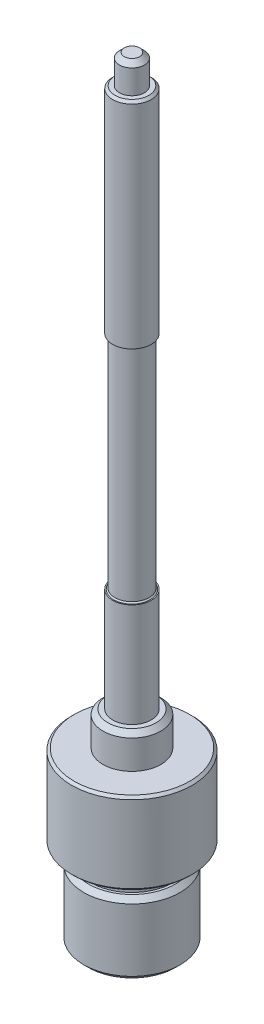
from build123d import *

# Parameters (mm, degrees)
CHAMFER1_SIZE = 1
CHAMFER2_SIZE = 0.5
CHAMFER3_SIZE = 0.25


with BuildPart() as part:
    # Sketch1 → Revolve1 (revolve)
    with BuildSketch(Plane(origin=(0, 0, 0), x_dir=(0, 0, -1), z_dir=(1, 0, 0))):
        Polygon((-6.973518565, 85.417009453), (-6.973518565, -44.582990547), (-11.973518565, -47.582990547), (-11.973518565, -60.582990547), (-14.973518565, -74.582990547), (-16.973518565, -74.582990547), (-16.973518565, -59.582990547), (-15.473518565, -59.582990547), (-15.473518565, -56.582990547), (-19.473518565, -56.582990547), (-19.473518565, -39.582990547), (-12.973518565, -39.582990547), (-12.973518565, -32.582990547), (-10.973518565, -32.582990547), (-10.973518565, -11.082990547), (-10.502774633, -11.082990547), (-10.502774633, 34.917009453), (-10.973518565, 34.917009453), (-10.973518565, 79.417009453), (-9.559922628, 79.417009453), (-9.559922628, 85.417009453), align=None)
    revolve(axis=Axis((0, 85.417009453, 6.973518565), (0, -1, 0)))

    # Chamfer1
    chamfer1_edges = [part.edges().sort_by_distance(p)[0] for p in [
        (0, -74.582990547, -3.026481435),
        (0, -59.582990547, -3.026481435),
        (0, -32.582990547, 0.973518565),
        (0, 85.417009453, 4.387114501),
    ]]
    chamfer(chamfer1_edges, length=CHAMFER1_SIZE)

    # Chamfer2
    chamfer2_edges = [part.edges().sort_by_distance(p)[0] for p in [
        (0, -56.582990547, -5.526481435),
        (0, -39.582990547, -5.526481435),
        (0, 79.417009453, 2.973518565),
    ]]
    chamfer(chamfer2_edges, length=CHAMFER2_SIZE)

    # Chamfer3
    chamfer3_edges = [part.edges().sort_by_distance(p)[0] for p in [
        (0, -11.082990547, 3.444262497),
        (0, 34.917009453, 3.444262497),
    ]]
    chamfer(chamfer3_edges, length=CHAMFER3_SIZE)


solid = part.part
